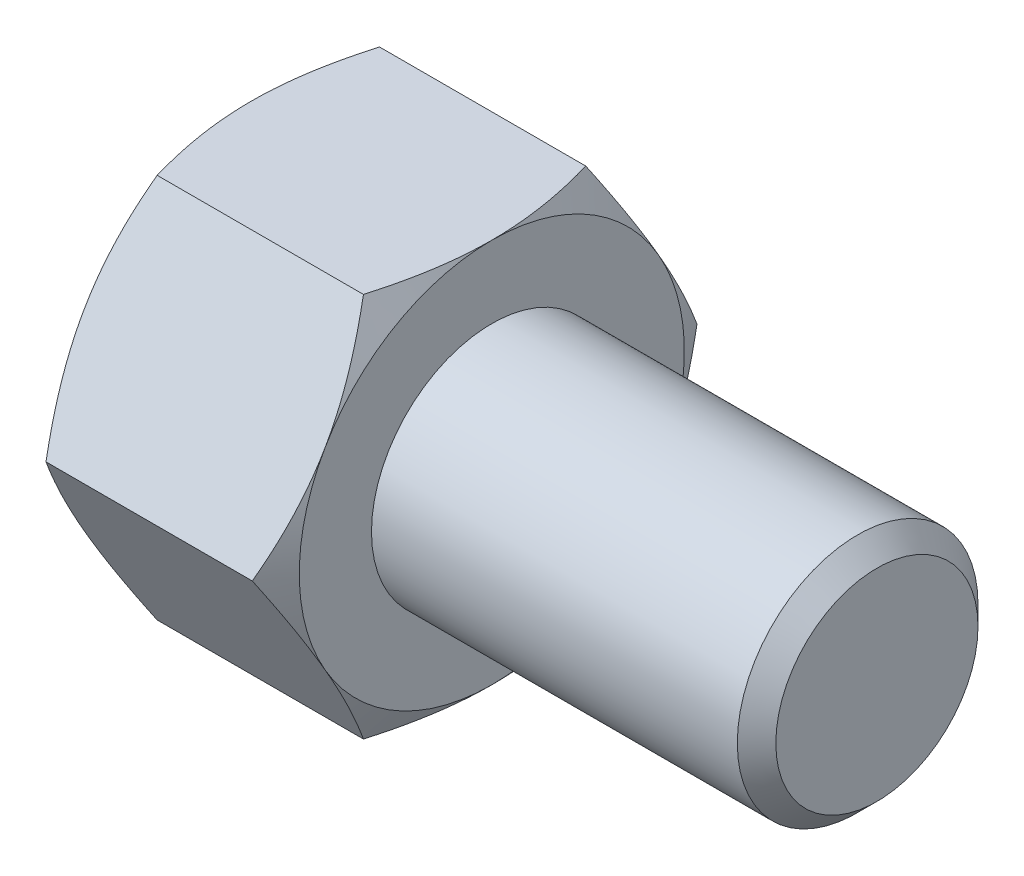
ISO-10303-21;
HEADER;
FILE_DESCRIPTION(('STEP AP214'),'2;1');
FILE_NAME('part.step','',(''),(''),'','','');
FILE_SCHEMA(('AUTOMOTIVE_DESIGN { 1 0 10303 214 1 1 1 1 }'));
ENDSEC;
DATA;
#1=APPLICATION_CONTEXT('core data for automotive mechanical design processes');
#2=APPLICATION_PROTOCOL_DEFINITION('international standard','automotive_design',2000,#1);
#3=PRODUCT_CONTEXT('',#1,'mechanical');
#4=PRODUCT('Part','Part','',(#3));
#5=PRODUCT_RELATED_PRODUCT_CATEGORY('part','',(#4));
#6=PRODUCT_DEFINITION_FORMATION('','',#4);
#7=PRODUCT_DEFINITION_CONTEXT('part definition',#1,'design');
#8=PRODUCT_DEFINITION('design','',#6,#7);
#9=PRODUCT_DEFINITION_SHAPE('','',#8);
#10=(LENGTH_UNIT() NAMED_UNIT(*) SI_UNIT(.MILLI.,.METRE.));
#11=(NAMED_UNIT(*) PLANE_ANGLE_UNIT() SI_UNIT($,.RADIAN.));
#12=(NAMED_UNIT(*) SI_UNIT($,.STERADIAN.) SOLID_ANGLE_UNIT());
#13=UNCERTAINTY_MEASURE_WITH_UNIT(LENGTH_MEASURE(1.E-05),#10,'distance_accuracy_value','');
#14=(GEOMETRIC_REPRESENTATION_CONTEXT(3) GLOBAL_UNCERTAINTY_ASSIGNED_CONTEXT((#13)) GLOBAL_UNIT_ASSIGNED_CONTEXT((#10,
#11,#12)) REPRESENTATION_CONTEXT('',''));
#15=CARTESIAN_POINT('',(0.,0.,0.));
#16=DIRECTION('',(0.,0.,1.));
#17=DIRECTION('',(1.,0.,0.));
#18=AXIS2_PLACEMENT_3D('',#15,#16,#17);
#19=CARTESIAN_POINT('',(2.5,4.,-2.3094010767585));
#20=DIRECTION('',(1.,0.,0.));
#21=DIRECTION('',(0.,0.,-1.));
#22=AXIS2_PLACEMENT_3D('',#19,#20,#21);
#23=PLANE('',#22);
#24=CARTESIAN_POINT('',(2.5,0.,0.));
#25=DIRECTION('',(1.,0.,0.));
#26=DIRECTION('',(0.,0.,-1.));
#27=AXIS2_PLACEMENT_3D('',#24,#25,#26);
#28=CIRCLE('',#27,4.);
#29=CARTESIAN_POINT('',(2.5,-2.,-3.46410161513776));
#30=VERTEX_POINT('',#29);
#31=CARTESIAN_POINT('',(2.5,2.,-3.46410161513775));
#32=VERTEX_POINT('',#31);
#33=EDGE_CURVE('E288',#30,#32,#28,.T.);
#34=ORIENTED_EDGE('',*,*,#33,.T.);
#35=CARTESIAN_POINT('',(2.5,4.,0.));
#36=VERTEX_POINT('',#35);
#37=EDGE_CURVE('E53',#32,#36,#28,.T.);
#38=ORIENTED_EDGE('',*,*,#37,.T.);
#39=CARTESIAN_POINT('',(2.5,2.,3.46410161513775));
#40=VERTEX_POINT('',#39);
#41=EDGE_CURVE('E297',#36,#40,#28,.T.);
#42=ORIENTED_EDGE('',*,*,#41,.T.);
#43=CARTESIAN_POINT('',(2.5,-2.,3.46410161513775));
#44=VERTEX_POINT('',#43);
#45=EDGE_CURVE('E302',#40,#44,#28,.T.);
#46=ORIENTED_EDGE('',*,*,#45,.T.);
#47=CARTESIAN_POINT('',(2.5,0.,0.));
#48=DIRECTION('',(-1.,0.,0.));
#49=DIRECTION('',(0.,-1.,0.));
#50=AXIS2_PLACEMENT_3D('',#47,#48,#49);
#51=CIRCLE('',#50,4.);
#52=CARTESIAN_POINT('',(2.5,-4.,0.));
#53=VERTEX_POINT('',#52);
#54=EDGE_CURVE('E193',#53,#44,#51,.T.);
#55=ORIENTED_EDGE('',*,*,#54,.F.);
#56=EDGE_CURVE('E61',#53,#30,#28,.T.);
#57=ORIENTED_EDGE('',*,*,#56,.T.);
#58=EDGE_LOOP('',(#34,#38,#42,#46,#55,#57));
#59=FACE_BOUND('',#58,.T.);
#60=CARTESIAN_POINT('',(2.5,0.,0.));
#61=DIRECTION('',(1.,0.,0.));
#62=DIRECTION('',(0.,0.,-1.));
#63=AXIS2_PLACEMENT_3D('',#60,#61,#62);
#64=CIRCLE('',#63,2.5);
#65=CARTESIAN_POINT('',(2.5,0.,-2.5));
#66=VERTEX_POINT('',#65);
#67=EDGE_CURVE('E324',#66,#66,#64,.T.);
#68=ORIENTED_EDGE('',*,*,#67,.F.);
#69=EDGE_LOOP('',(#68));
#70=FACE_BOUND('',#69,.T.);
#71=ADVANCED_FACE('F37',(#59,#70),#23,.T.);
#72=CARTESIAN_POINT('',(2.5,0.,-4.61880215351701));
#73=DIRECTION('',(0.,-0.5,0.866025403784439));
#74=DIRECTION('',(0.,-0.866025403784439,-0.5));
#75=AXIS2_PLACEMENT_3D('',#72,#73,#74);
#76=PLANE('',#75);
#77=CARTESIAN_POINT('',(2.14266774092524,-0.000200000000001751,-4.61891762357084));
#78=CARTESIAN_POINT('',(2.20128212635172,0.175579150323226,-4.5174314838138));
#79=CARTESIAN_POINT('',(2.25458967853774,0.352875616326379,-4.41506932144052));
#80=CARTESIAN_POINT('',(2.3476383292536,0.710538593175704,-4.2085725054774));
#81=CARTESIAN_POINT('',(2.3873465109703,0.890911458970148,-4.10443418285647));
#82=CARTESIAN_POINT('',(2.44915778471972,1.24942181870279,-3.89744813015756));
#83=CARTESIAN_POINT('',(2.47167226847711,1.42750415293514,-3.79463224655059));
#84=CARTESIAN_POINT('',(2.49854937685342,1.78450671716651,-3.58851671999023));
#85=CARTESIAN_POINT('',(2.50293425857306,1.9634256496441,-3.48521782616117));
#86=CARTESIAN_POINT('',(2.49380992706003,2.29774284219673,-3.29219970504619));
#87=CARTESIAN_POINT('',(2.48254104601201,2.45319115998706,-3.20245157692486));
#88=CARTESIAN_POINT('',(2.44682600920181,2.76307505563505,-3.02354002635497));
#89=CARTESIAN_POINT('',(2.42236765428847,2.91750956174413,-2.93437722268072));
#90=CARTESIAN_POINT('',(2.36122393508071,3.22803232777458,-2.75509682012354));
#91=CARTESIAN_POINT('',(2.32427939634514,3.3840812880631,-2.6650019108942));
#92=CARTESIAN_POINT('',(2.24042992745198,3.69385183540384,-2.486155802));
#93=CARTESIAN_POINT('',(2.19354469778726,3.84757739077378,-2.39740231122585));
#94=CARTESIAN_POINT('',(2.14266774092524,4.0002,-2.30928560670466));
#95=B_SPLINE_CURVE_WITH_KNOTS('',3,(#77,#78,#79,#80,#81,#82,#83,#84,#85,#86,#87,#88,#89,#90,#91,
#92,#93,#94),.UNSPECIFIED.,.F.,.F.,(4,2,2,2,2,2,2,2,4),(0.,0.634047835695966,1.26961969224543,
1.88946157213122,2.50854226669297,3.04757825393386,3.58711366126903,4.13861653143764,
4.68903648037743),.UNSPECIFIED.);
#96=CARTESIAN_POINT('',(2.14273441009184,0.,-4.61880215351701));
#97=VERTEX_POINT('',#96);
#98=EDGE_CURVE('E373',#97,#32,#95,.T.);
#99=ORIENTED_EDGE('',*,*,#98,.F.);
#100=DIRECTION('',(-1.,0.,0.));
#101=VECTOR('',#100,1.);
#102=CARTESIAN_POINT('',(2.5,0.,-4.61880215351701));
#103=LINE('',#102,#101);
#104=CARTESIAN_POINT('',(-2.14273441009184,0.,-4.61880215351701));
#105=VERTEX_POINT('',#104);
#106=EDGE_CURVE('E264',#97,#105,#103,.T.);
#107=ORIENTED_EDGE('',*,*,#106,.T.);
#108=CARTESIAN_POINT('',(-2.14266774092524,4.0002,-2.30928560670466));
#109=CARTESIAN_POINT('',(-2.20128212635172,3.82442084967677,-2.4107717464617));
#110=CARTESIAN_POINT('',(-2.25458967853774,3.64712438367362,-2.51313390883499));
#111=CARTESIAN_POINT('',(-2.3476383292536,3.28946140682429,-2.71963072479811));
#112=CARTESIAN_POINT('',(-2.3873465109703,3.10908854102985,-2.82376904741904));
#113=CARTESIAN_POINT('',(-2.44915778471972,2.75057818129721,-3.03075510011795));
#114=CARTESIAN_POINT('',(-2.47167226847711,2.57249584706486,-3.13357098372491));
#115=CARTESIAN_POINT('',(-2.49854937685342,2.21549328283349,-3.33968651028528));
#116=CARTESIAN_POINT('',(-2.50293425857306,2.0365743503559,-3.44298540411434));
#117=CARTESIAN_POINT('',(-2.49380992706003,1.70225715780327,-3.63600352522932));
#118=CARTESIAN_POINT('',(-2.48254104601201,1.54680884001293,-3.72575165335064));
#119=CARTESIAN_POINT('',(-2.44682600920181,1.23692494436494,-3.90466320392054));
#120=CARTESIAN_POINT('',(-2.42236765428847,1.08249043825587,-3.99382600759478));
#121=CARTESIAN_POINT('',(-2.36122393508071,0.771967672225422,-4.17310641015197));
#122=CARTESIAN_POINT('',(-2.32427939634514,0.615918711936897,-4.26320131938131));
#123=CARTESIAN_POINT('',(-2.24042992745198,0.306148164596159,-4.4420474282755));
#124=CARTESIAN_POINT('',(-2.19354469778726,0.152422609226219,-4.53080091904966));
#125=CARTESIAN_POINT('',(-2.14266774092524,-0.0002000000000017,-4.61891762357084));
#126=B_SPLINE_CURVE_WITH_KNOTS('',3,(#108,#109,#110,#111,#112,#113,#114,#115,#116,#117,#118,
#119,#120,#121,#122,#123,#124,#125),.UNSPECIFIED.,.F.,.F.,(4,2,2,2,2,2,2,2,4),(0.,
0.634047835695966,1.26961969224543,1.88946157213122,2.50854226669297,3.04757825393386,
3.58711366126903,4.13861653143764,4.68903648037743),.UNSPECIFIED.);
#127=CARTESIAN_POINT('',(-2.5,2.,-3.46410161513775));
#128=VERTEX_POINT('',#127);
#129=EDGE_CURVE('E374',#128,#105,#126,.T.);
#130=ORIENTED_EDGE('',*,*,#129,.F.);
#131=CARTESIAN_POINT('',(-2.14273441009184,4.,-2.3094010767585));
#132=VERTEX_POINT('',#131);
#133=EDGE_CURVE('E376',#132,#128,#126,.T.);
#134=ORIENTED_EDGE('',*,*,#133,.F.);
#135=DIRECTION('',(-1.,0.,0.));
#136=VECTOR('',#135,1.);
#137=CARTESIAN_POINT('',(2.5,4.,-2.3094010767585));
#138=LINE('',#137,#136);
#139=CARTESIAN_POINT('',(2.14273441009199,4.,-2.30940107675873));
#140=VERTEX_POINT('',#139);
#141=EDGE_CURVE('E279',#140,#132,#138,.T.);
#142=ORIENTED_EDGE('',*,*,#141,.F.);
#143=EDGE_CURVE('E229',#32,#140,#95,.T.);
#144=ORIENTED_EDGE('',*,*,#143,.F.);
#145=EDGE_LOOP('',(#99,#107,#130,#134,#142,#144));
#146=FACE_BOUND('',#145,.T.);
#147=ADVANCED_FACE('F148',(#146),#76,.F.);
#148=CARTESIAN_POINT('',(2.5,4.,-2.3094010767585));
#149=DIRECTION('',(0.,-1.,0.));
#150=DIRECTION('',(0.,0.,-1.));
#151=AXIS2_PLACEMENT_3D('',#148,#149,#150);
#152=PLANE('',#151);
#153=CARTESIAN_POINT('',(0.508290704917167,4.,-6.28479524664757));
#154=CARTESIAN_POINT('',(0.593700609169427,4.,-6.10939349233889));
#155=CARTESIAN_POINT('',(0.678314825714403,4.,-5.93359774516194));
#156=CARTESIAN_POINT('',(0.845505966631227,4.,-5.58100905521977));
#157=CARTESIAN_POINT('',(0.928082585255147,4.,-5.40421596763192));
#158=CARTESIAN_POINT('',(1.09115082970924,4.,-5.04855089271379));
#159=CARTESIAN_POINT('',(1.17162934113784,4.,-4.86967287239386));
#160=CARTESIAN_POINT('',(1.32940015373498,4.,-4.51052237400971));
#161=CARTESIAN_POINT('',(1.40669260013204,4.,-4.33024995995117));
#162=CARTESIAN_POINT('',(1.55980205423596,4.,-3.96189114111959));
#163=CARTESIAN_POINT('',(1.63548049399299,4.,-3.77374683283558));
#164=CARTESIAN_POINT('',(1.78130452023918,4.,-3.39528725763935));
#165=CARTESIAN_POINT('',(1.85144949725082,4.,-3.2049717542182));
#166=CARTESIAN_POINT('',(1.9844245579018,4.,-2.82219775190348));
#167=CARTESIAN_POINT('',(2.0472687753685,4.,-2.62974421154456));
#168=CARTESIAN_POINT('',(2.16367969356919,4.,-2.24207725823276));
#169=CARTESIAN_POINT('',(2.21724923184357,4.,-2.04686470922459));
#170=CARTESIAN_POINT('',(2.31230316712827,4.,-1.65467425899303));
#171=CARTESIAN_POINT('',(2.3538563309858,4.,-1.45771333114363));
#172=CARTESIAN_POINT('',(2.42259036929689,4.,-1.06125849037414));
#173=CARTESIAN_POINT('',(2.44977273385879,4.,-0.861764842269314));
#174=CARTESIAN_POINT('',(2.48724473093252,4.,-0.46387918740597));
#175=CARTESIAN_POINT('',(2.49775780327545,4.,-0.265508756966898));
#176=CARTESIAN_POINT('',(2.50159342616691,4.,0.131417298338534));
#177=CARTESIAN_POINT('',(2.49491584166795,4.,0.32997292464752));
#178=CARTESIAN_POINT('',(2.46964892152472,4.,0.664692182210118));
#179=CARTESIAN_POINT('',(2.45537089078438,4.,0.801202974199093));
#180=CARTESIAN_POINT('',(2.4195349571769,4.,1.07327201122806));
#181=CARTESIAN_POINT('',(2.39797613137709,4.,1.20883013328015));
#182=CARTESIAN_POINT('',(2.32350663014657,4.,1.61386939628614));
#183=CARTESIAN_POINT('',(2.26081499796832,4.,1.8815748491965));
#184=CARTESIAN_POINT('',(2.15151174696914,4.,2.28197262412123));
#185=CARTESIAN_POINT('',(2.11200931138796,4.,2.41672443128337));
#186=CARTESIAN_POINT('',(2.02875235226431,4.,2.6849206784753));
#187=CARTESIAN_POINT('',(1.9849977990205,4.,2.81836510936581));
#188=CARTESIAN_POINT('',(1.8939510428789,4.,3.08398596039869));
#189=CARTESIAN_POINT('',(1.84665989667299,4.,3.21616274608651));
#190=CARTESIAN_POINT('',(1.74911111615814,4.,3.47941134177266));
#191=CARTESIAN_POINT('',(1.69885352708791,4.,3.61048316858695));
#192=CARTESIAN_POINT('',(1.57132952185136,4.,3.93385125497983));
#193=CARTESIAN_POINT('',(1.4926014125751,4.,4.12557021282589));
#194=CARTESIAN_POINT('',(1.33096938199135,4.,4.50724553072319));
#195=CARTESIAN_POINT('',(1.24806513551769,4.,4.69720175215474));
#196=CARTESIAN_POINT('',(1.0789699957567,4.,5.07569950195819));
#197=CARTESIAN_POINT('',(0.992778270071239,4.,5.26424065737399));
#198=CARTESIAN_POINT('',(0.817801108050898,4.,5.64011758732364));
#199=CARTESIAN_POINT('',(0.729015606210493,4.,5.8274533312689));
#200=CARTESIAN_POINT('',(0.459343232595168,4.,6.38844423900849));
#201=CARTESIAN_POINT('',(0.275356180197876,4.,6.76060781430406));
#202=CARTESIAN_POINT('',(-0.0980437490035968,4.,7.50211228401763));
#203=CARTESIAN_POINT('',(-0.287455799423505,4.,7.87145359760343));
#204=CARTESIAN_POINT('',(-0.65261225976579,4.,8.57450173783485));
#205=CARTESIAN_POINT('',(-0.828024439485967,4.,8.90838144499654));
#206=CARTESIAN_POINT('',(-1.18119023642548,4.,9.57491712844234));
#207=CARTESIAN_POINT('',(-1.35894395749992,4.,9.90757304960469));
#208=CARTESIAN_POINT('',(-1.71570660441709,4.,10.5709822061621));
#209=CARTESIAN_POINT('',(-1.89471047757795,3.99999999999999,10.9017381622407));
#210=CARTESIAN_POINT('',(-2.25409287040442,3.99999999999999,11.5624752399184));
#211=CARTESIAN_POINT('',(-2.43447130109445,3.99999999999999,11.8924564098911));
#212=CARTESIAN_POINT('',(-2.61535751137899,3.99999999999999,12.2221569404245));
#213=B_SPLINE_CURVE_WITH_KNOTS('',3,(#153,#154,#155,#156,#157,#158,#159,#160,#161,#162,#163,
#164,#165,#166,#167,#168,#169,#170,#171,#172,#173,#174,#175,#176,#177,#178,#179,#180,#181,#182,
#183,#184,#185,#186,#187,#188,#189,#190,#191,#192,#193,#194,#195,#196,#197,#198,#199,#200,#201,
#202,#203,#204,#205,#206,#207,#208,#209,#210,#211,#212),.UNSPECIFIED.,.F.,.F.,(4,2,2,2,2,2,2,2,
2,2,2,2,2,2,2,2,2,2,2,2,2,2,2,2,2,2,2,2,2,4),(0.,0.585280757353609,1.17064881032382,
1.75906864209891,2.34746162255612,2.95577704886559,3.56415938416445,4.17134357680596,
4.77834167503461,5.38179402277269,5.98518378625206,6.58041501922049,7.17565092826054,
7.5872191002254,7.99883946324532,8.82250155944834,9.24373134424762,9.66496407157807,
10.086071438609,10.5071723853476,11.1288656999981,11.7506074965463,12.3725077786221,
12.9944237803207,14.2398211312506,15.4850297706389,16.6164791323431,17.7479788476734,
18.8762380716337,20.0044248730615),.UNSPECIFIED.);
#214=EDGE_CURVE('E227',#140,#36,#213,.T.);
#215=ORIENTED_EDGE('',*,*,#214,.F.);
#216=ORIENTED_EDGE('',*,*,#141,.T.);
#217=CARTESIAN_POINT('',(-0.508290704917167,4.,-6.28479524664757));
#218=CARTESIAN_POINT('',(-0.593700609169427,4.,-6.10939349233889));
#219=CARTESIAN_POINT('',(-0.678314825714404,4.,-5.93359774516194));
#220=CARTESIAN_POINT('',(-0.845505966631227,4.,-5.58100905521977));
#221=CARTESIAN_POINT('',(-0.928082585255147,4.,-5.40421596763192));
#222=CARTESIAN_POINT('',(-1.09115082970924,4.,-5.04855089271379));
#223=CARTESIAN_POINT('',(-1.17162934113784,4.,-4.86967287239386));
#224=CARTESIAN_POINT('',(-1.32940015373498,4.,-4.51052237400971));
#225=CARTESIAN_POINT('',(-1.40669260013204,4.,-4.33024995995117));
#226=CARTESIAN_POINT('',(-1.55980205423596,4.,-3.96189114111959));
#227=CARTESIAN_POINT('',(-1.63548049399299,4.,-3.77374683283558));
#228=CARTESIAN_POINT('',(-1.78130452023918,4.,-3.39528725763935));
#229=CARTESIAN_POINT('',(-1.85144949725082,4.,-3.2049717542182));
#230=CARTESIAN_POINT('',(-1.9844245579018,4.,-2.82219775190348));
#231=CARTESIAN_POINT('',(-2.0472687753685,4.,-2.62974421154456));
#232=CARTESIAN_POINT('',(-2.16367969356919,4.,-2.24207725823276));
#233=CARTESIAN_POINT('',(-2.21724923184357,4.,-2.04686470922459));
#234=CARTESIAN_POINT('',(-2.31230316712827,4.,-1.65467425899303));
#235=CARTESIAN_POINT('',(-2.3538563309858,4.,-1.45771333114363));
#236=CARTESIAN_POINT('',(-2.42259036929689,4.,-1.06125849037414));
#237=CARTESIAN_POINT('',(-2.44977273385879,4.,-0.861764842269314));
#238=CARTESIAN_POINT('',(-2.48724473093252,4.,-0.46387918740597));
#239=CARTESIAN_POINT('',(-2.49775780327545,4.,-0.265508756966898));
#240=CARTESIAN_POINT('',(-2.50159342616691,4.,0.131417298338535));
#241=CARTESIAN_POINT('',(-2.49491584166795,4.,0.32997292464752));
#242=CARTESIAN_POINT('',(-2.46964892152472,4.,0.664692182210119));
#243=CARTESIAN_POINT('',(-2.45537089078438,4.,0.801202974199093));
#244=CARTESIAN_POINT('',(-2.4195349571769,4.,1.07327201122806));
#245=CARTESIAN_POINT('',(-2.39797613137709,4.,1.20883013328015));
#246=CARTESIAN_POINT('',(-2.32350663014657,4.,1.61386939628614));
#247=CARTESIAN_POINT('',(-2.26081499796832,4.,1.8815748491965));
#248=CARTESIAN_POINT('',(-2.15151174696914,4.,2.28197262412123));
#249=CARTESIAN_POINT('',(-2.11200931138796,4.,2.41672443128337));
#250=CARTESIAN_POINT('',(-2.02875235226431,4.,2.6849206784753));
#251=CARTESIAN_POINT('',(-1.9849977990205,4.,2.81836510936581));
#252=CARTESIAN_POINT('',(-1.8939510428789,4.,3.08398596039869));
#253=CARTESIAN_POINT('',(-1.84665989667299,4.,3.21616274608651));
#254=CARTESIAN_POINT('',(-1.74911111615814,4.,3.47941134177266));
#255=CARTESIAN_POINT('',(-1.69885352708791,4.,3.61048316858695));
#256=CARTESIAN_POINT('',(-1.57132952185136,4.,3.93385125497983));
#257=CARTESIAN_POINT('',(-1.4926014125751,4.,4.12557021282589));
#258=CARTESIAN_POINT('',(-1.33096938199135,4.,4.50724553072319));
#259=CARTESIAN_POINT('',(-1.24806513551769,4.,4.69720175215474));
#260=CARTESIAN_POINT('',(-1.0789699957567,4.,5.07569950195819));
#261=CARTESIAN_POINT('',(-0.99277827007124,4.,5.26424065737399));
#262=CARTESIAN_POINT('',(-0.8178011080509,4.,5.64011758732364));
#263=CARTESIAN_POINT('',(-0.729015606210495,4.,5.8274533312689));
#264=CARTESIAN_POINT('',(-0.459343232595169,4.,6.38844423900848));
#265=CARTESIAN_POINT('',(-0.275356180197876,4.,6.76060781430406));
#266=CARTESIAN_POINT('',(0.0980437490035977,4.,7.50211228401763));
#267=CARTESIAN_POINT('',(0.287455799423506,4.,7.87145359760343));
#268=CARTESIAN_POINT('',(0.65261225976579,4.,8.57450173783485));
#269=CARTESIAN_POINT('',(0.828024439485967,4.,8.90838144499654));
#270=CARTESIAN_POINT('',(1.18119023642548,4.,9.57491712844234));
#271=CARTESIAN_POINT('',(1.35894395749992,4.,9.90757304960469));
#272=CARTESIAN_POINT('',(1.71570660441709,4.,10.5709822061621));
#273=CARTESIAN_POINT('',(1.89471047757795,3.99999999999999,10.9017381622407));
#274=CARTESIAN_POINT('',(2.25409287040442,3.99999999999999,11.5624752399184));
#275=CARTESIAN_POINT('',(2.43447130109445,3.99999999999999,11.8924564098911));
#276=CARTESIAN_POINT('',(2.61535751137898,3.99999999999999,12.2221569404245));
#277=B_SPLINE_CURVE_WITH_KNOTS('',3,(#217,#218,#219,#220,#221,#222,#223,#224,#225,#226,#227,
#228,#229,#230,#231,#232,#233,#234,#235,#236,#237,#238,#239,#240,#241,#242,#243,#244,#245,#246,
#247,#248,#249,#250,#251,#252,#253,#254,#255,#256,#257,#258,#259,#260,#261,#262,#263,#264,#265,
#266,#267,#268,#269,#270,#271,#272,#273,#274,#275,#276),.UNSPECIFIED.,.F.,.F.,(4,2,2,2,2,2,2,2,
2,2,2,2,2,2,2,2,2,2,2,2,2,2,2,2,2,2,2,2,2,4),(0.,0.585280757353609,1.17064881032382,
1.75906864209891,2.34746162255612,2.95577704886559,3.56415938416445,4.17134357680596,
4.77834167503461,5.38179402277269,5.98518378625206,6.58041501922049,7.17565092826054,
7.5872191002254,7.99883946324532,8.82250155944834,9.24373134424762,9.66496407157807,
10.086071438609,10.5071723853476,11.1288656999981,11.7506074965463,12.3725077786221,
12.9944237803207,14.2398211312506,15.4850297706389,16.6164791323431,17.7479788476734,
18.8762380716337,20.0044248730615),.UNSPECIFIED.);
#278=CARTESIAN_POINT('',(-2.5,4.,0.));
#279=VERTEX_POINT('',#278);
#280=EDGE_CURVE('E241',#279,#132,#277,.F.);
#281=ORIENTED_EDGE('',*,*,#280,.F.);
#282=CARTESIAN_POINT('',(-2.14273441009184,4.,2.3094010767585));
#283=VERTEX_POINT('',#282);
#284=EDGE_CURVE('E249',#283,#279,#277,.F.);
#285=ORIENTED_EDGE('',*,*,#284,.F.);
#286=DIRECTION('',(-1.,0.,0.));
#287=VECTOR('',#286,1.);
#288=CARTESIAN_POINT('',(2.5,4.,2.3094010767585));
#289=LINE('',#288,#287);
#290=CARTESIAN_POINT('',(2.14273441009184,4.,2.3094010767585));
#291=VERTEX_POINT('',#290);
#292=EDGE_CURVE('E276',#291,#283,#289,.T.);
#293=ORIENTED_EDGE('',*,*,#292,.F.);
#294=EDGE_CURVE('E221',#36,#291,#213,.T.);
#295=ORIENTED_EDGE('',*,*,#294,.F.);
#296=EDGE_LOOP('',(#215,#216,#281,#285,#293,#295));
#297=FACE_BOUND('',#296,.T.);
#298=ADVANCED_FACE('F153',(#297),#152,.F.);
#299=CARTESIAN_POINT('',(2.5,4.,2.3094010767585));
#300=DIRECTION('',(0.,-0.5,-0.866025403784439));
#301=DIRECTION('',(0.,0.866025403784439,-0.5));
#302=AXIS2_PLACEMENT_3D('',#299,#300,#301);
#303=PLANE('',#302);
#304=CARTESIAN_POINT('',(2.14266774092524,4.0002,2.30928560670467));
#305=CARTESIAN_POINT('',(2.20128212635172,3.82442084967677,2.4107717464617));
#306=CARTESIAN_POINT('',(2.25458967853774,3.64712438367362,2.51313390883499));
#307=CARTESIAN_POINT('',(2.3476383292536,3.28946140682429,2.71963072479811));
#308=CARTESIAN_POINT('',(2.3873465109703,3.10908854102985,2.82376904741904));
#309=CARTESIAN_POINT('',(2.44915778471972,2.75057818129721,3.03075510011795));
#310=CARTESIAN_POINT('',(2.47167226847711,2.57249584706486,3.13357098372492));
#311=CARTESIAN_POINT('',(2.49854937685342,2.21549328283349,3.33968651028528));
#312=CARTESIAN_POINT('',(2.50293425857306,2.0365743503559,3.44298540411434));
#313=CARTESIAN_POINT('',(2.49380992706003,1.70225715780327,3.63600352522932));
#314=CARTESIAN_POINT('',(2.48254104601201,1.54680884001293,3.72575165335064));
#315=CARTESIAN_POINT('',(2.44682600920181,1.23692494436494,3.90466320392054));
#316=CARTESIAN_POINT('',(2.42236765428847,1.08249043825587,3.99382600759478));
#317=CARTESIAN_POINT('',(2.36122393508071,0.771967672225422,4.17310641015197));
#318=CARTESIAN_POINT('',(2.32427939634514,0.615918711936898,4.26320131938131));
#319=CARTESIAN_POINT('',(2.24042992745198,0.306148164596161,4.4420474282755));
#320=CARTESIAN_POINT('',(2.19354469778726,0.152422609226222,4.53080091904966));
#321=CARTESIAN_POINT('',(2.14266774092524,-0.000199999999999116,4.61891762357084));
#322=B_SPLINE_CURVE_WITH_KNOTS('',3,(#304,#305,#306,#307,#308,#309,#310,#311,#312,#313,#314,
#315,#316,#317,#318,#319,#320,#321),.UNSPECIFIED.,.F.,.F.,(4,2,2,2,2,2,2,2,4),(0.,
0.634047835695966,1.26961969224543,1.88946157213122,2.50854226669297,3.04757825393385,
3.58711366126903,4.13861653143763,4.68903648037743),.UNSPECIFIED.);
#323=EDGE_CURVE('E228',#291,#40,#322,.T.);
#324=ORIENTED_EDGE('',*,*,#323,.F.);
#325=ORIENTED_EDGE('',*,*,#292,.T.);
#326=CARTESIAN_POINT('',(-2.14266774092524,-0.000199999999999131,4.61891762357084));
#327=CARTESIAN_POINT('',(-2.20128212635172,0.175579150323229,4.5174314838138));
#328=CARTESIAN_POINT('',(-2.25458967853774,0.352875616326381,4.41506932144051));
#329=CARTESIAN_POINT('',(-2.3476383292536,0.710538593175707,4.20857250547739));
#330=CARTESIAN_POINT('',(-2.3873465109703,0.890911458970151,4.10443418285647));
#331=CARTESIAN_POINT('',(-2.44915778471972,1.24942181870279,3.89744813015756));
#332=CARTESIAN_POINT('',(-2.47167226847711,1.42750415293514,3.79463224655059));
#333=CARTESIAN_POINT('',(-2.49854937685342,1.78450671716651,3.58851671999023));
#334=CARTESIAN_POINT('',(-2.50293425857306,1.9634256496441,3.48521782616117));
#335=CARTESIAN_POINT('',(-2.49380992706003,2.29774284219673,3.29219970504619));
#336=CARTESIAN_POINT('',(-2.48254104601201,2.45319115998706,3.20245157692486));
#337=CARTESIAN_POINT('',(-2.44682600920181,2.76307505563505,3.02354002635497));
#338=CARTESIAN_POINT('',(-2.42236765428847,2.91750956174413,2.93437722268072));
#339=CARTESIAN_POINT('',(-2.36122393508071,3.22803232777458,2.75509682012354));
#340=CARTESIAN_POINT('',(-2.32427939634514,3.3840812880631,2.6650019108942));
#341=CARTESIAN_POINT('',(-2.24042992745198,3.69385183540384,2.48615580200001));
#342=CARTESIAN_POINT('',(-2.19354469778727,3.84757739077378,2.39740231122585));
#343=CARTESIAN_POINT('',(-2.14266774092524,4.0002,2.30928560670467));
#344=B_SPLINE_CURVE_WITH_KNOTS('',3,(#326,#327,#328,#329,#330,#331,#332,#333,#334,#335,#336,
#337,#338,#339,#340,#341,#342,#343),.UNSPECIFIED.,.F.,.F.,(4,2,2,2,2,2,2,2,4),(0.,
0.634047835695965,1.26961969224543,1.88946157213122,2.50854226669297,3.04757825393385,
3.58711366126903,4.13861653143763,4.68903648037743),.UNSPECIFIED.);
#345=CARTESIAN_POINT('',(-2.5,2.,3.46410161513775));
#346=VERTEX_POINT('',#345);
#347=EDGE_CURVE('E255',#346,#283,#344,.T.);
#348=ORIENTED_EDGE('',*,*,#347,.F.);
#349=CARTESIAN_POINT('',(-2.14273441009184,0.,4.618802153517));
#350=VERTEX_POINT('',#349);
#351=EDGE_CURVE('E262',#350,#346,#344,.T.);
#352=ORIENTED_EDGE('',*,*,#351,.F.);
#353=DIRECTION('',(-1.,0.,0.));
#354=VECTOR('',#353,1.);
#355=CARTESIAN_POINT('',(2.5,0.,4.618802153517));
#356=LINE('',#355,#354);
#357=CARTESIAN_POINT('',(2.14273441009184,0.,4.618802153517));
#358=VERTEX_POINT('',#357);
#359=EDGE_CURVE('E273',#358,#350,#356,.T.);
#360=ORIENTED_EDGE('',*,*,#359,.F.);
#361=EDGE_CURVE('E215',#40,#358,#322,.T.);
#362=ORIENTED_EDGE('',*,*,#361,.F.);
#363=EDGE_LOOP('',(#324,#325,#348,#352,#360,#362));
#364=FACE_BOUND('',#363,.T.);
#365=ADVANCED_FACE('F235',(#364),#303,.F.);
#366=CARTESIAN_POINT('',(2.5,0.,4.618802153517));
#367=DIRECTION('',(0.,0.5,-0.866025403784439));
#368=DIRECTION('',(0.,0.866025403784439,0.5));
#369=AXIS2_PLACEMENT_3D('',#366,#367,#368);
#370=PLANE('',#369);
#371=CARTESIAN_POINT('',(2.14266774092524,0.000200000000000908,4.61891762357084));
#372=CARTESIAN_POINT('',(2.20128212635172,-0.175579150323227,4.5174314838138));
#373=CARTESIAN_POINT('',(2.25458967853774,-0.352875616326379,4.41506932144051));
#374=CARTESIAN_POINT('',(2.3476383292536,-0.710538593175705,4.20857250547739));
#375=CARTESIAN_POINT('',(2.3873465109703,-0.890911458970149,4.10443418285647));
#376=CARTESIAN_POINT('',(2.44915778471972,-1.24942181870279,3.89744813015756));
#377=CARTESIAN_POINT('',(2.47167226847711,-1.42750415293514,3.79463224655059));
#378=CARTESIAN_POINT('',(2.49854937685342,-1.78450671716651,3.58851671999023));
#379=CARTESIAN_POINT('',(2.50293425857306,-1.9634256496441,3.48521782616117));
#380=CARTESIAN_POINT('',(2.49380992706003,-2.29774284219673,3.29219970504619));
#381=CARTESIAN_POINT('',(2.48254104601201,-2.45319115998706,3.20245157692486));
#382=CARTESIAN_POINT('',(2.44682600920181,-2.76307505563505,3.02354002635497));
#383=CARTESIAN_POINT('',(2.42236765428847,-2.91750956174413,2.93437722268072));
#384=CARTESIAN_POINT('',(2.36122393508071,-3.22803232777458,2.75509682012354));
#385=CARTESIAN_POINT('',(2.32427939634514,-3.3840812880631,2.6650019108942));
#386=CARTESIAN_POINT('',(2.24042992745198,-3.69385183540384,2.48615580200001));
#387=CARTESIAN_POINT('',(2.19354469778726,-3.84757739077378,2.39740231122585));
#388=CARTESIAN_POINT('',(2.14266774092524,-4.0002,2.30928560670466));
#389=B_SPLINE_CURVE_WITH_KNOTS('',3,(#371,#372,#373,#374,#375,#376,#377,#378,#379,#380,#381,
#382,#383,#384,#385,#386,#387,#388),.UNSPECIFIED.,.F.,.F.,(4,2,2,2,2,2,2,2,4),(0.,
0.634047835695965,1.26961969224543,1.88946157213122,2.50854226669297,3.04757825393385,
3.58711366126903,4.13861653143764,4.68903648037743),.UNSPECIFIED.);
#390=EDGE_CURVE('E312',#358,#44,#389,.T.);
#391=ORIENTED_EDGE('',*,*,#390,.F.);
#392=ORIENTED_EDGE('',*,*,#359,.T.);
#393=CARTESIAN_POINT('',(-2.14266774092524,-4.0002,2.30928560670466));
#394=CARTESIAN_POINT('',(-2.20128212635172,-3.82442084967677,2.4107717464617));
#395=CARTESIAN_POINT('',(-2.25458967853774,-3.64712438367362,2.51313390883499));
#396=CARTESIAN_POINT('',(-2.3476383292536,-3.28946140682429,2.71963072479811));
#397=CARTESIAN_POINT('',(-2.3873465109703,-3.10908854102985,2.82376904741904));
#398=CARTESIAN_POINT('',(-2.44915778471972,-2.75057818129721,3.03075510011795));
#399=CARTESIAN_POINT('',(-2.47167226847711,-2.57249584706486,3.13357098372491));
#400=CARTESIAN_POINT('',(-2.49854937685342,-2.21549328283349,3.33968651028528));
#401=CARTESIAN_POINT('',(-2.50293425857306,-2.0365743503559,3.44298540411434));
#402=CARTESIAN_POINT('',(-2.49380992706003,-1.70225715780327,3.63600352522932));
#403=CARTESIAN_POINT('',(-2.48254104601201,-1.54680884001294,3.72575165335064));
#404=CARTESIAN_POINT('',(-2.44682600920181,-1.23692494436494,3.90466320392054));
#405=CARTESIAN_POINT('',(-2.42236765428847,-1.08249043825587,3.99382600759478));
#406=CARTESIAN_POINT('',(-2.36122393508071,-0.771967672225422,4.17310641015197));
#407=CARTESIAN_POINT('',(-2.32427939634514,-0.615918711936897,4.26320131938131));
#408=CARTESIAN_POINT('',(-2.24042992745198,-0.30614816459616,4.4420474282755));
#409=CARTESIAN_POINT('',(-2.19354469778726,-0.15242260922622,4.53080091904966));
#410=CARTESIAN_POINT('',(-2.14266774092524,0.000200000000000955,4.61891762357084));
#411=B_SPLINE_CURVE_WITH_KNOTS('',3,(#393,#394,#395,#396,#397,#398,#399,#400,#401,#402,#403,
#404,#405,#406,#407,#408,#409,#410),.UNSPECIFIED.,.F.,.F.,(4,2,2,2,2,2,2,2,4),(0.,
0.634047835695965,1.26961969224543,1.88946157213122,2.50854226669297,3.04757825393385,
3.58711366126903,4.13861653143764,4.68903648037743),.UNSPECIFIED.);
#412=CARTESIAN_POINT('',(-2.5,-2.,3.46410161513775));
#413=VERTEX_POINT('',#412);
#414=EDGE_CURVE('E263',#413,#350,#411,.T.);
#415=ORIENTED_EDGE('',*,*,#414,.F.);
#416=CARTESIAN_POINT('',(-2.14273441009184,-4.,2.3094010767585));
#417=VERTEX_POINT('',#416);
#418=EDGE_CURVE('E250',#417,#413,#411,.T.);
#419=ORIENTED_EDGE('',*,*,#418,.F.);
#420=DIRECTION('',(-1.,0.,0.));
#421=VECTOR('',#420,1.);
#422=CARTESIAN_POINT('',(2.5,-4.,2.3094010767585));
#423=LINE('',#422,#421);
#424=CARTESIAN_POINT('',(2.14273441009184,-4.,2.3094010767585));
#425=VERTEX_POINT('',#424);
#426=EDGE_CURVE('E270',#425,#417,#423,.T.);
#427=ORIENTED_EDGE('',*,*,#426,.F.);
#428=EDGE_CURVE('E210',#44,#425,#389,.T.);
#429=ORIENTED_EDGE('',*,*,#428,.F.);
#430=EDGE_LOOP('',(#391,#392,#415,#419,#427,#429));
#431=FACE_BOUND('',#430,.T.);
#432=ADVANCED_FACE('F401',(#431),#370,.F.);
#433=CARTESIAN_POINT('',(2.5,-4.,2.3094010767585));
#434=DIRECTION('',(0.,1.,0.));
#435=DIRECTION('',(0.,0.,1.));
#436=AXIS2_PLACEMENT_3D('',#433,#434,#435);
#437=PLANE('',#436);
#438=CARTESIAN_POINT('',(0.508290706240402,-4.,-6.28479524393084));
#439=CARTESIAN_POINT('',(0.593700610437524,-4.,-6.10939348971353));
#440=CARTESIAN_POINT('',(0.678314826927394,-4.,-5.93359774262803));
#441=CARTESIAN_POINT('',(0.845505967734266,-4.,-5.58100905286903));
#442=CARTESIAN_POINT('',(0.928082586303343,-4.,-5.40421596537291));
#443=CARTESIAN_POINT('',(1.09115083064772,-4.,-5.04855089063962));
#444=CARTESIAN_POINT('',(1.17162934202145,-4.,-4.86967287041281));
#445=CARTESIAN_POINT('',(1.32940015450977,-4.,-4.51052237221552));
#446=CARTESIAN_POINT('',(1.40669260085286,-4.,-4.33024995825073));
#447=CARTESIAN_POINT('',(1.55980205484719,-4.,-3.96189113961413));
#448=CARTESIAN_POINT('',(1.63548049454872,-4.,-3.77374683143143));
#449=CARTESIAN_POINT('',(1.78130452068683,-4.,-3.39528725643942));
#450=CARTESIAN_POINT('',(1.85144949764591,-4.,-3.2049717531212));
#451=CARTESIAN_POINT('',(1.98442455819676,-4.,-2.82219775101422));
#452=CARTESIAN_POINT('',(2.04726877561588,-4.,-2.62974421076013));
#453=CARTESIAN_POINT('',(2.16367969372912,-4.,-2.24207725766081));
#454=CARTESIAN_POINT('',(2.21724923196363,-4.,-2.04686470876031));
#455=CARTESIAN_POINT('',(2.31230316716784,-4.,-1.65467425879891));
#456=CARTESIAN_POINT('',(2.35385633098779,-4.,-1.45771333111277));
#457=CARTESIAN_POINT('',(2.4225903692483,-4.,-1.06125849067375));
#458=CARTESIAN_POINT('',(2.44977273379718,-4.,-0.861764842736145));
#459=CARTESIAN_POINT('',(2.48724473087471,-4.,-0.463879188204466));
#460=CARTESIAN_POINT('',(2.49775780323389,-4.,-0.265508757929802));
#461=CARTESIAN_POINT('',(2.50159342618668,-4.,0.131417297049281));
#462=CARTESIAN_POINT('',(2.49491584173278,-4.,0.329972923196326));
#463=CARTESIAN_POINT('',(2.46964892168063,-4.,0.664692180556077));
#464=CARTESIAN_POINT('',(2.45537089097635,-4.,0.80120297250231));
#465=CARTESIAN_POINT('',(2.41953495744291,-4.,1.07327200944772));
#466=CARTESIAN_POINT('',(2.39797613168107,-4.,1.20883013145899));
#467=CARTESIAN_POINT('',(2.32350663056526,-4.,1.6138693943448));
#468=CARTESIAN_POINT('',(2.26081499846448,-4.,1.88157484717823));
#469=CARTESIAN_POINT('',(2.15151174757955,-4.,2.28197262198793));
#470=CARTESIAN_POINT('',(2.1120093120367,-4.,2.41672442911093));
#471=CARTESIAN_POINT('',(2.02875235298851,-4.,2.68492067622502));
#472=CARTESIAN_POINT('',(1.98499779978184,-4.,2.81836510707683));
#473=CARTESIAN_POINT('',(1.89395104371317,-4.,3.08398595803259));
#474=CARTESIAN_POINT('',(1.84665989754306,-4.,3.216162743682));
#475=CARTESIAN_POINT('',(1.74911111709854,-4.,3.47941133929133));
#476=CARTESIAN_POINT('',(1.69885352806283,-4.,3.61048316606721));
#477=CARTESIAN_POINT('',(1.57132952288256,-4.,3.93385125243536));
#478=CARTESIAN_POINT('',(1.49260141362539,-4.,4.12557021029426));
#479=CARTESIAN_POINT('',(1.330969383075,-4.,4.50724552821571));
#480=CARTESIAN_POINT('',(1.24806513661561,-4.,4.69720174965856));
#481=CARTESIAN_POINT('',(1.07896999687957,-4.,5.07569949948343));
#482=CARTESIAN_POINT('',(0.992778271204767,-4.,5.26424065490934));
#483=CARTESIAN_POINT('',(0.817801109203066,-4.,5.64011758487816));
#484=CARTESIAN_POINT('',(0.729015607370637,-4.,5.82745332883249));
#485=CARTESIAN_POINT('',(0.459343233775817,-4.,6.38844423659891));
#486=CARTESIAN_POINT('',(0.275356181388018,-4.,6.76060781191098));
#487=CARTESIAN_POINT('',(-0.0980437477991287,-4.,7.50211228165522));
#488=CARTESIAN_POINT('',(-0.287455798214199,-4.,7.87145359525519));
#489=CARTESIAN_POINT('',(-0.652612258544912,-4.,8.57450173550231));
#490=CARTESIAN_POINT('',(-0.828024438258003,-4.,8.90838144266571));
#491=CARTESIAN_POINT('',(-1.1811902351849,-4.,9.5749171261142));
#492=CARTESIAN_POINT('',(-1.3589439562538,-4.,9.90757304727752));
#493=CARTESIAN_POINT('',(-1.71570660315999,-4.,10.5709822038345));
#494=CARTESIAN_POINT('',(-1.89471047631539,-4.,10.9017381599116));
#495=CARTESIAN_POINT('',(-2.25409286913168,-4.,11.562475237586));
#496=CARTESIAN_POINT('',(-2.43447129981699,-4.,11.8924564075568));
#497=CARTESIAN_POINT('',(-2.61535751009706,-4.,12.2221569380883));
#498=B_SPLINE_CURVE_WITH_KNOTS('',3,(#438,#439,#440,#441,#442,#443,#444,#445,#446,#447,#448,
#449,#450,#451,#452,#453,#454,#455,#456,#457,#458,#459,#460,#461,#462,#463,#464,#465,#466,#467,
#468,#469,#470,#471,#472,#473,#474,#475,#476,#477,#478,#479,#480,#481,#482,#483,#484,#485,#486,
#487,#488,#489,#490,#491,#492,#493,#494,#495,#496,#497),.UNSPECIFIED.,.F.,.F.,(4,2,2,2,2,2,2,2,
2,2,2,2,2,2,2,2,2,2,2,2,2,2,2,2,2,2,2,2,2,4),(0.,0.585280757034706,1.17064880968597,
1.75906864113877,2.34746162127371,2.95577704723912,3.56415938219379,4.17134357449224,
4.7783416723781,5.38179401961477,5.98518378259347,6.58041501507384,7.1756509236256,
7.58721909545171,7.99883945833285,8.82250155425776,9.24373133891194,9.66496406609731,
10.0860714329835,10.5071723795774,11.1288656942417,11.7506074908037,12.3725077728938,
12.9944237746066,14.2398211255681,15.4850297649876,16.6164791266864,17.7479788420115,
18.8762380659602,20.0044248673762),.UNSPECIFIED.);
#499=EDGE_CURVE('E323',#425,#53,#498,.F.);
#500=ORIENTED_EDGE('',*,*,#499,.F.);
#501=ORIENTED_EDGE('',*,*,#426,.T.);
#502=CARTESIAN_POINT('',(-0.508290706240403,-4.,-6.28479524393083));
#503=CARTESIAN_POINT('',(-0.593700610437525,-4.,-6.10939348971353));
#504=CARTESIAN_POINT('',(-0.678314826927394,-4.,-5.93359774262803));
#505=CARTESIAN_POINT('',(-0.845505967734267,-4.,-5.58100905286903));
#506=CARTESIAN_POINT('',(-0.928082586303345,-4.,-5.40421596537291));
#507=CARTESIAN_POINT('',(-1.09115083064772,-4.,-5.04855089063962));
#508=CARTESIAN_POINT('',(-1.17162934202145,-4.,-4.86967287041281));
#509=CARTESIAN_POINT('',(-1.32940015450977,-4.,-4.51052237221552));
#510=CARTESIAN_POINT('',(-1.40669260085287,-4.,-4.33024995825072));
#511=CARTESIAN_POINT('',(-1.55980205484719,-4.,-3.96189113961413));
#512=CARTESIAN_POINT('',(-1.63548049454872,-4.,-3.77374683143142));
#513=CARTESIAN_POINT('',(-1.78130452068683,-4.,-3.39528725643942));
#514=CARTESIAN_POINT('',(-1.85144949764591,-4.,-3.20497175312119));
#515=CARTESIAN_POINT('',(-1.98442455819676,-4.,-2.82219775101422));
#516=CARTESIAN_POINT('',(-2.04726877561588,-4.,-2.62974421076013));
#517=CARTESIAN_POINT('',(-2.16367969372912,-4.,-2.24207725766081));
#518=CARTESIAN_POINT('',(-2.21724923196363,-4.,-2.04686470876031));
#519=CARTESIAN_POINT('',(-2.31230316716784,-4.,-1.65467425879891));
#520=CARTESIAN_POINT('',(-2.35385633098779,-4.,-1.45771333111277));
#521=CARTESIAN_POINT('',(-2.4225903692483,-4.,-1.06125849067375));
#522=CARTESIAN_POINT('',(-2.44977273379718,-4.,-0.861764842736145));
#523=CARTESIAN_POINT('',(-2.48724473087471,-4.,-0.463879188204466));
#524=CARTESIAN_POINT('',(-2.49775780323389,-4.,-0.265508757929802));
#525=CARTESIAN_POINT('',(-2.50159342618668,-4.,0.131417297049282));
#526=CARTESIAN_POINT('',(-2.49491584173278,-4.,0.329972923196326));
#527=CARTESIAN_POINT('',(-2.46964892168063,-4.,0.664692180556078));
#528=CARTESIAN_POINT('',(-2.45537089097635,-4.,0.801202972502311));
#529=CARTESIAN_POINT('',(-2.41953495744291,-4.,1.07327200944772));
#530=CARTESIAN_POINT('',(-2.39797613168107,-4.,1.20883013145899));
#531=CARTESIAN_POINT('',(-2.32350663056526,-4.,1.6138693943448));
#532=CARTESIAN_POINT('',(-2.26081499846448,-4.,1.88157484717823));
#533=CARTESIAN_POINT('',(-2.15151174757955,-4.,2.28197262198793));
#534=CARTESIAN_POINT('',(-2.1120093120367,-4.,2.41672442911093));
#535=CARTESIAN_POINT('',(-2.02875235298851,-4.,2.68492067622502));
#536=CARTESIAN_POINT('',(-1.98499779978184,-4.,2.81836510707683));
#537=CARTESIAN_POINT('',(-1.89395104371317,-4.,3.0839859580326));
#538=CARTESIAN_POINT('',(-1.84665989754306,-4.,3.216162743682));
#539=CARTESIAN_POINT('',(-1.74911111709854,-4.,3.47941133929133));
#540=CARTESIAN_POINT('',(-1.69885352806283,-4.,3.61048316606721));
#541=CARTESIAN_POINT('',(-1.57132952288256,-4.,3.93385125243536));
#542=CARTESIAN_POINT('',(-1.49260141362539,-4.,4.12557021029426));
#543=CARTESIAN_POINT('',(-1.330969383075,-4.,4.50724552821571));
#544=CARTESIAN_POINT('',(-1.24806513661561,-4.,4.69720174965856));
#545=CARTESIAN_POINT('',(-1.07896999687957,-4.,5.07569949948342));
#546=CARTESIAN_POINT('',(-0.992778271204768,-4.,5.26424065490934));
#547=CARTESIAN_POINT('',(-0.817801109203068,-4.,5.64011758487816));
#548=CARTESIAN_POINT('',(-0.729015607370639,-4.,5.82745332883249));
#549=CARTESIAN_POINT('',(-0.459343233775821,-4.,6.3884442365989));
#550=CARTESIAN_POINT('',(-0.275356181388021,-4.,6.76060781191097));
#551=CARTESIAN_POINT('',(0.0980437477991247,-4.,7.50211228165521));
#552=CARTESIAN_POINT('',(0.287455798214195,-4.,7.87145359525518));
#553=CARTESIAN_POINT('',(0.652612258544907,-4.,8.5745017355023));
#554=CARTESIAN_POINT('',(0.828024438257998,-4.,8.9083814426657));
#555=CARTESIAN_POINT('',(1.1811902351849,-4.,9.57491712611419));
#556=CARTESIAN_POINT('',(1.3589439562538,-4.,9.90757304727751));
#557=CARTESIAN_POINT('',(1.71570660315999,-4.,10.5709822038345));
#558=CARTESIAN_POINT('',(1.89471047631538,-4.,10.9017381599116));
#559=CARTESIAN_POINT('',(2.25409286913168,-4.,11.562475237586));
#560=CARTESIAN_POINT('',(2.43447129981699,-4.,11.8924564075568));
#561=CARTESIAN_POINT('',(2.61535751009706,-4.,12.2221569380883));
#562=B_SPLINE_CURVE_WITH_KNOTS('',3,(#502,#503,#504,#505,#506,#507,#508,#509,#510,#511,#512,
#513,#514,#515,#516,#517,#518,#519,#520,#521,#522,#523,#524,#525,#526,#527,#528,#529,#530,#531,
#532,#533,#534,#535,#536,#537,#538,#539,#540,#541,#542,#543,#544,#545,#546,#547,#548,#549,#550,
#551,#552,#553,#554,#555,#556,#557,#558,#559,#560,#561),.UNSPECIFIED.,.F.,.F.,(4,2,2,2,2,2,2,2,
2,2,2,2,2,2,2,2,2,2,2,2,2,2,2,2,2,2,2,2,2,4),(0.,0.585280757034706,1.17064880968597,
1.75906864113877,2.34746162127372,2.95577704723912,3.56415938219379,4.17134357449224,
4.7783416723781,5.38179401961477,5.98518378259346,6.58041501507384,7.1756509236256,
7.5872190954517,7.99883945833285,8.82250155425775,9.24373133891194,9.66496406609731,
10.0860714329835,10.5071723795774,11.1288656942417,11.7506074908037,12.3725077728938,
12.9944237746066,14.2398211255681,15.4850297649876,16.6164791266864,17.7479788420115,
18.8762380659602,20.0044248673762),.UNSPECIFIED.);
#563=CARTESIAN_POINT('',(-2.5,-4.,0.));
#564=VERTEX_POINT('',#563);
#565=EDGE_CURVE('E380',#564,#417,#562,.T.);
#566=ORIENTED_EDGE('',*,*,#565,.F.);
#567=CARTESIAN_POINT('',(-2.14273441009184,-4.,-2.3094010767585));
#568=VERTEX_POINT('',#567);
#569=EDGE_CURVE('E339',#568,#564,#562,.T.);
#570=ORIENTED_EDGE('',*,*,#569,.F.);
#571=DIRECTION('',(-1.,0.,0.));
#572=VECTOR('',#571,1.);
#573=CARTESIAN_POINT('',(2.5,-4.,-2.3094010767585));
#574=LINE('',#573,#572);
#575=CARTESIAN_POINT('',(2.14273441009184,-4.,-2.3094010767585));
#576=VERTEX_POINT('',#575);
#577=EDGE_CURVE('E267',#576,#568,#574,.T.);
#578=ORIENTED_EDGE('',*,*,#577,.F.);
#579=EDGE_CURVE('E195',#53,#576,#498,.F.);
#580=ORIENTED_EDGE('',*,*,#579,.F.);
#581=EDGE_LOOP('',(#500,#501,#566,#570,#578,#580));
#582=FACE_BOUND('',#581,.T.);
#583=ADVANCED_FACE('F172',(#582),#437,.F.);
#584=CARTESIAN_POINT('',(2.5,-4.,-2.3094010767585));
#585=DIRECTION('',(0.,0.5,0.866025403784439));
#586=DIRECTION('',(0.,-0.866025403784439,0.5));
#587=AXIS2_PLACEMENT_3D('',#584,#585,#586);
#588=PLANE('',#587);
#589=CARTESIAN_POINT('',(2.14266774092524,-4.0002,-2.30928560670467));
#590=CARTESIAN_POINT('',(2.20128212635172,-3.82442084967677,-2.41077174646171));
#591=CARTESIAN_POINT('',(2.25458967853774,-3.64712438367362,-2.51313390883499));
#592=CARTESIAN_POINT('',(2.3476383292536,-3.28946140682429,-2.71963072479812));
#593=CARTESIAN_POINT('',(2.3873465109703,-3.10908854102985,-2.82376904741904));
#594=CARTESIAN_POINT('',(2.44915778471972,-2.75057818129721,-3.03075510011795));
#595=CARTESIAN_POINT('',(2.47167226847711,-2.57249584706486,-3.13357098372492));
#596=CARTESIAN_POINT('',(2.49854937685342,-2.21549328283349,-3.33968651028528));
#597=CARTESIAN_POINT('',(2.50293425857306,-2.0365743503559,-3.44298540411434));
#598=CARTESIAN_POINT('',(2.49380992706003,-1.70225715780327,-3.63600352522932));
#599=CARTESIAN_POINT('',(2.48254104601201,-1.54680884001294,-3.72575165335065));
#600=CARTESIAN_POINT('',(2.44682600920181,-1.23692494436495,-3.90466320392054));
#601=CARTESIAN_POINT('',(2.42236765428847,-1.08249043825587,-3.99382600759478));
#602=CARTESIAN_POINT('',(2.36122393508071,-0.771967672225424,-4.17310641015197));
#603=CARTESIAN_POINT('',(2.32427939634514,-0.6159187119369,-4.26320131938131));
#604=CARTESIAN_POINT('',(2.24042992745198,-0.306148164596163,-4.4420474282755));
#605=CARTESIAN_POINT('',(2.19354469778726,-0.152422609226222,-4.53080091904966));
#606=CARTESIAN_POINT('',(2.14266774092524,0.000199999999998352,-4.61891762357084));
#607=B_SPLINE_CURVE_WITH_KNOTS('',3,(#589,#590,#591,#592,#593,#594,#595,#596,#597,#598,#599,
#600,#601,#602,#603,#604,#605,#606),.UNSPECIFIED.,.F.,.F.,(4,2,2,2,2,2,2,2,4),(0.,
0.634047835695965,1.26961969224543,1.88946157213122,2.50854226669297,3.04757825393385,
3.58711366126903,4.13861653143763,4.68903648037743),.UNSPECIFIED.);
#608=EDGE_CURVE('E192',#576,#30,#607,.T.);
#609=ORIENTED_EDGE('',*,*,#608,.F.);
#610=ORIENTED_EDGE('',*,*,#577,.T.);
#611=CARTESIAN_POINT('',(-2.14266774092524,0.000199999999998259,-4.61891762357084));
#612=CARTESIAN_POINT('',(-2.20128212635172,-0.17557915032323,-4.5174314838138));
#613=CARTESIAN_POINT('',(-2.25458967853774,-0.352875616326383,-4.41506932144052));
#614=CARTESIAN_POINT('',(-2.3476383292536,-0.710538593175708,-4.20857250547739));
#615=CARTESIAN_POINT('',(-2.3873465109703,-0.890911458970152,-4.10443418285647));
#616=CARTESIAN_POINT('',(-2.44915778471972,-1.24942181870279,-3.89744813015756));
#617=CARTESIAN_POINT('',(-2.47167226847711,-1.42750415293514,-3.79463224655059));
#618=CARTESIAN_POINT('',(-2.49854937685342,-1.78450671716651,-3.58851671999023));
#619=CARTESIAN_POINT('',(-2.50293425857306,-1.9634256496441,-3.48521782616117));
#620=CARTESIAN_POINT('',(-2.49380992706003,-2.29774284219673,-3.29219970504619));
#621=CARTESIAN_POINT('',(-2.48254104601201,-2.45319115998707,-3.20245157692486));
#622=CARTESIAN_POINT('',(-2.44682600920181,-2.76307505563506,-3.02354002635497));
#623=CARTESIAN_POINT('',(-2.42236765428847,-2.91750956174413,-2.93437722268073));
#624=CARTESIAN_POINT('',(-2.36122393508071,-3.22803232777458,-2.75509682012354));
#625=CARTESIAN_POINT('',(-2.32427939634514,-3.3840812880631,-2.6650019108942));
#626=CARTESIAN_POINT('',(-2.24042992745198,-3.69385183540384,-2.48615580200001));
#627=CARTESIAN_POINT('',(-2.19354469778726,-3.84757739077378,-2.39740231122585));
#628=CARTESIAN_POINT('',(-2.14266774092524,-4.0002,-2.30928560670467));
#629=B_SPLINE_CURVE_WITH_KNOTS('',3,(#611,#612,#613,#614,#615,#616,#617,#618,#619,#620,#621,
#622,#623,#624,#625,#626,#627,#628),.UNSPECIFIED.,.F.,.F.,(4,2,2,2,2,2,2,2,4),(0.,
0.634047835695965,1.26961969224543,1.88946157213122,2.50854226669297,3.04757825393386,
3.58711366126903,4.13861653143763,4.68903648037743),.UNSPECIFIED.);
#630=CARTESIAN_POINT('',(-2.5,-2.,-3.46410161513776));
#631=VERTEX_POINT('',#630);
#632=EDGE_CURVE('E178',#631,#568,#629,.T.);
#633=ORIENTED_EDGE('',*,*,#632,.F.);
#634=EDGE_CURVE('E320',#105,#631,#629,.T.);
#635=ORIENTED_EDGE('',*,*,#634,.F.);
#636=ORIENTED_EDGE('',*,*,#106,.F.);
#637=EDGE_CURVE('E185',#30,#97,#607,.T.);
#638=ORIENTED_EDGE('',*,*,#637,.F.);
#639=EDGE_LOOP('',(#609,#610,#633,#635,#636,#638));
#640=FACE_BOUND('',#639,.T.);
#641=ADVANCED_FACE('F167',(#640),#588,.F.);
#642=CARTESIAN_POINT('',(-2.5,0.,0.));
#643=DIRECTION('',(1.,0.,0.));
#644=DIRECTION('',(0.,1.,0.));
#645=AXIS2_PLACEMENT_3D('',#642,#643,#644);
#646=CONICAL_SURFACE('',#645,4.,1.0471975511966);
#647=ORIENTED_EDGE('',*,*,#129,.T.);
#648=ORIENTED_EDGE('',*,*,#634,.T.);
#649=CARTESIAN_POINT('',(-2.5,0.,0.));
#650=DIRECTION('',(1.,0.,0.));
#651=DIRECTION('',(0.,0.,-1.));
#652=AXIS2_PLACEMENT_3D('',#649,#650,#651);
#653=CIRCLE('',#652,4.);
#654=EDGE_CURVE('E282',#631,#128,#653,.T.);
#655=ORIENTED_EDGE('',*,*,#654,.T.);
#656=EDGE_LOOP('',(#647,#648,#655));
#657=FACE_BOUND('',#656,.T.);
#658=ADVANCED_FACE('F171',(#657),#646,.T.);
#659=ORIENTED_EDGE('',*,*,#569,.T.);
#660=EDGE_CURVE('E286',#564,#631,#653,.T.);
#661=ORIENTED_EDGE('',*,*,#660,.T.);
#662=ORIENTED_EDGE('',*,*,#632,.T.);
#663=EDGE_LOOP('',(#659,#661,#662));
#664=FACE_BOUND('',#663,.T.);
#665=ADVANCED_FACE('F363',(#664),#646,.T.);
#666=ORIENTED_EDGE('',*,*,#418,.T.);
#667=CARTESIAN_POINT('',(-2.5,0.,0.));
#668=DIRECTION('',(-1.,0.,0.));
#669=DIRECTION('',(0.,-1.,0.));
#670=AXIS2_PLACEMENT_3D('',#667,#668,#669);
#671=CIRCLE('',#670,4.);
#672=EDGE_CURVE('E321',#564,#413,#671,.T.);
#673=ORIENTED_EDGE('',*,*,#672,.F.);
#674=ORIENTED_EDGE('',*,*,#565,.T.);
#675=EDGE_LOOP('',(#666,#673,#674));
#676=FACE_BOUND('',#675,.T.);
#677=ADVANCED_FACE('F392',(#676),#646,.T.);
#678=ORIENTED_EDGE('',*,*,#351,.T.);
#679=EDGE_CURVE('E329',#346,#413,#653,.T.);
#680=ORIENTED_EDGE('',*,*,#679,.T.);
#681=ORIENTED_EDGE('',*,*,#414,.T.);
#682=EDGE_LOOP('',(#678,#680,#681));
#683=FACE_BOUND('',#682,.T.);
#684=ADVANCED_FACE('F158',(#683),#646,.T.);
#685=ORIENTED_EDGE('',*,*,#347,.T.);
#686=ORIENTED_EDGE('',*,*,#284,.T.);
#687=EDGE_CURVE('E332',#279,#346,#653,.T.);
#688=ORIENTED_EDGE('',*,*,#687,.T.);
#689=EDGE_LOOP('',(#685,#686,#688));
#690=FACE_BOUND('',#689,.T.);
#691=ADVANCED_FACE('F408',(#690),#646,.T.);
#692=ORIENTED_EDGE('',*,*,#280,.T.);
#693=ORIENTED_EDGE('',*,*,#133,.T.);
#694=EDGE_CURVE('E287',#128,#279,#653,.T.);
#695=ORIENTED_EDGE('',*,*,#694,.T.);
#696=EDGE_LOOP('',(#692,#693,#695));
#697=FACE_BOUND('',#696,.T.);
#698=ADVANCED_FACE('F165',(#697),#646,.T.);
#699=CARTESIAN_POINT('',(-2.5,4.,-2.3094010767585));
#700=DIRECTION('',(1.,0.,0.));
#701=DIRECTION('',(0.,0.,-1.));
#702=AXIS2_PLACEMENT_3D('',#699,#700,#701);
#703=PLANE('',#702);
#704=CARTESIAN_POINT('',(-2.5,0.,0.));
#705=DIRECTION('',(-1.,0.,0.));
#706=DIRECTION('',(0.,0.,1.));
#707=AXIS2_PLACEMENT_3D('',#704,#705,#706);
#708=CIRCLE('',#707,2.1);
#709=CARTESIAN_POINT('',(-2.5,0.,2.1));
#710=VERTEX_POINT('',#709);
#711=EDGE_CURVE('E317',#710,#710,#708,.T.);
#712=ORIENTED_EDGE('',*,*,#711,.F.);
#713=EDGE_LOOP('',(#712));
#714=FACE_BOUND('',#713,.T.);
#715=ORIENTED_EDGE('',*,*,#694,.F.);
#716=ORIENTED_EDGE('',*,*,#654,.F.);
#717=ORIENTED_EDGE('',*,*,#660,.F.);
#718=ORIENTED_EDGE('',*,*,#672,.T.);
#719=ORIENTED_EDGE('',*,*,#679,.F.);
#720=ORIENTED_EDGE('',*,*,#687,.F.);
#721=EDGE_LOOP('',(#715,#716,#717,#718,#719,#720));
#722=FACE_BOUND('',#721,.T.);
#723=ADVANCED_FACE('F161',(#714,#722),#703,.F.);
#724=CARTESIAN_POINT('',(2.5,0.,0.));
#725=DIRECTION('',(-1.,0.,0.));
#726=DIRECTION('',(0.,1.,0.));
#727=AXIS2_PLACEMENT_3D('',#724,#725,#726);
#728=CONICAL_SURFACE('',#727,4.,1.0471975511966);
#729=ORIENTED_EDGE('',*,*,#98,.T.);
#730=ORIENTED_EDGE('',*,*,#33,.F.);
#731=ORIENTED_EDGE('',*,*,#637,.T.);
#732=EDGE_LOOP('',(#729,#730,#731));
#733=FACE_BOUND('',#732,.T.);
#734=ADVANCED_FACE('F164',(#733),#728,.T.);
#735=ORIENTED_EDGE('',*,*,#579,.T.);
#736=ORIENTED_EDGE('',*,*,#608,.T.);
#737=ORIENTED_EDGE('',*,*,#56,.F.);
#738=EDGE_LOOP('',(#735,#736,#737));
#739=FACE_BOUND('',#738,.T.);
#740=ADVANCED_FACE('F202',(#739),#728,.T.);
#741=ORIENTED_EDGE('',*,*,#428,.T.);
#742=ORIENTED_EDGE('',*,*,#499,.T.);
#743=ORIENTED_EDGE('',*,*,#54,.T.);
#744=EDGE_LOOP('',(#741,#742,#743));
#745=FACE_BOUND('',#744,.T.);
#746=ADVANCED_FACE('F349',(#745),#728,.T.);
#747=ORIENTED_EDGE('',*,*,#361,.T.);
#748=ORIENTED_EDGE('',*,*,#390,.T.);
#749=ORIENTED_EDGE('',*,*,#45,.F.);
#750=EDGE_LOOP('',(#747,#748,#749));
#751=FACE_BOUND('',#750,.T.);
#752=ADVANCED_FACE('F544',(#751),#728,.T.);
#753=ORIENTED_EDGE('',*,*,#294,.T.);
#754=ORIENTED_EDGE('',*,*,#323,.T.);
#755=ORIENTED_EDGE('',*,*,#41,.F.);
#756=EDGE_LOOP('',(#753,#754,#755));
#757=FACE_BOUND('',#756,.T.);
#758=ADVANCED_FACE('F537',(#757),#728,.T.);
#759=ORIENTED_EDGE('',*,*,#143,.T.);
#760=ORIENTED_EDGE('',*,*,#214,.T.);
#761=ORIENTED_EDGE('',*,*,#37,.F.);
#762=EDGE_LOOP('',(#759,#760,#761));
#763=FACE_BOUND('',#762,.T.);
#764=ADVANCED_FACE('F143',(#763),#728,.T.);
#765=CARTESIAN_POINT('',(0.5,0.,0.));
#766=DIRECTION('',(-1.,0.,0.));
#767=DIRECTION('',(0.,0.,1.));
#768=AXIS2_PLACEMENT_3D('',#765,#766,#767);
#769=CYLINDRICAL_SURFACE('',#768,2.1);
#770=CARTESIAN_POINT('',(0.499999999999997,0.,0.));
#771=DIRECTION('',(1.,0.,0.));
#772=DIRECTION('',(0.,1.,0.));
#773=AXIS2_PLACEMENT_3D('',#770,#771,#772);
#774=CIRCLE('',#773,2.1);
#775=CARTESIAN_POINT('',(0.499999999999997,2.1,0.));
#776=VERTEX_POINT('',#775);
#777=EDGE_CURVE('E327',#776,#776,#774,.T.);
#778=ORIENTED_EDGE('',*,*,#777,.T.);
#779=EDGE_LOOP('',(#778));
#780=FACE_BOUND('',#779,.T.);
#781=ORIENTED_EDGE('',*,*,#711,.T.);
#782=EDGE_LOOP('',(#781));
#783=FACE_BOUND('',#782,.T.);
#784=ADVANCED_FACE('F133',(#780,#783),#769,.F.);
#785=CARTESIAN_POINT('',(1.7124355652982,0.,0.));
#786=DIRECTION('',(-1.,0.,0.));
#787=DIRECTION('',(0.,-1.,0.));
#788=AXIS2_PLACEMENT_3D('',#785,#786,#787);
#789=CONICAL_SURFACE('',#788,0.,1.0471975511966);
#790=ORIENTED_EDGE('',*,*,#777,.F.);
#791=EDGE_LOOP('',(#790));
#792=FACE_BOUND('',#791,.T.);
#793=CARTESIAN_POINT('',(1.7124355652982,0.,0.));
#794=VERTEX_POINT('',#793);
#795=VERTEX_LOOP('',#794);
#796=FACE_BOUND('',#795,.T.);
#797=ADVANCED_FACE('F130',(#792,#796),#789,.F.);
#798=CARTESIAN_POINT('',(10.5,0.,0.));
#799=DIRECTION('',(-1.,0.,0.));
#800=DIRECTION('',(0.,0.,1.));
#801=AXIS2_PLACEMENT_3D('',#798,#799,#800);
#802=CYLINDRICAL_SURFACE('',#801,2.5);
#803=CARTESIAN_POINT('',(10.1,0.,0.));
#804=DIRECTION('',(1.,0.,0.));
#805=DIRECTION('',(0.,0.,-1.));
#806=AXIS2_PLACEMENT_3D('',#803,#804,#805);
#807=CIRCLE('',#806,2.5);
#808=CARTESIAN_POINT('',(10.1,0.,-2.5));
#809=VERTEX_POINT('',#808);
#810=EDGE_CURVE('E11',#809,#809,#807,.F.);
#811=ORIENTED_EDGE('',*,*,#810,.T.);
#812=EDGE_LOOP('',(#811));
#813=FACE_BOUND('',#812,.T.);
#814=ORIENTED_EDGE('',*,*,#67,.T.);
#815=EDGE_LOOP('',(#814));
#816=FACE_BOUND('',#815,.T.);
#817=ADVANCED_FACE('F132',(#813,#816),#802,.T.);
#818=CARTESIAN_POINT('',(10.5,0.,0.));
#819=DIRECTION('',(1.,0.,0.));
#820=DIRECTION('',(0.,0.,-1.));
#821=AXIS2_PLACEMENT_3D('',#818,#819,#820);
#822=PLANE('',#821);
#823=CARTESIAN_POINT('',(10.5,0.,0.));
#824=DIRECTION('',(1.,0.,0.));
#825=DIRECTION('',(0.,0.,-1.));
#826=AXIS2_PLACEMENT_3D('',#823,#824,#825);
#827=CIRCLE('',#826,2.1);
#828=CARTESIAN_POINT('',(10.5,0.,-2.1));
#829=VERTEX_POINT('',#828);
#830=EDGE_CURVE('E46',#829,#829,#827,.T.);
#831=ORIENTED_EDGE('',*,*,#830,.T.);
#832=EDGE_LOOP('',(#831));
#833=FACE_BOUND('',#832,.T.);
#834=ADVANCED_FACE('F140',(#833),#822,.T.);
#835=CARTESIAN_POINT('',(10.5,0.,0.));
#836=DIRECTION('',(-1.,0.,0.));
#837=DIRECTION('',(0.,0.,1.));
#838=AXIS2_PLACEMENT_3D('',#835,#836,#837);
#839=CONICAL_SURFACE('',#838,2.1,0.785398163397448);
#840=ORIENTED_EDGE('',*,*,#810,.F.);
#841=EDGE_LOOP('',(#840));
#842=FACE_BOUND('',#841,.T.);
#843=ORIENTED_EDGE('',*,*,#830,.F.);
#844=EDGE_LOOP('',(#843));
#845=FACE_BOUND('',#844,.T.);
#846=ADVANCED_FACE('F39',(#842,#845),#839,.T.);
#847=CLOSED_SHELL('',(#71,#147,#298,#365,#432,#583,#641,#658,#665,#677,#684,#691,#698,#723,#734,
#740,#746,#752,#758,#764,#784,#797,#817,#834,#846));
#848=MANIFOLD_SOLID_BREP('B2',#847);
#849=ADVANCED_BREP_SHAPE_REPRESENTATION('',(#18,#848),#14);
#850=SHAPE_DEFINITION_REPRESENTATION(#9,#849);
ENDSEC;
END-ISO-10303-21;
